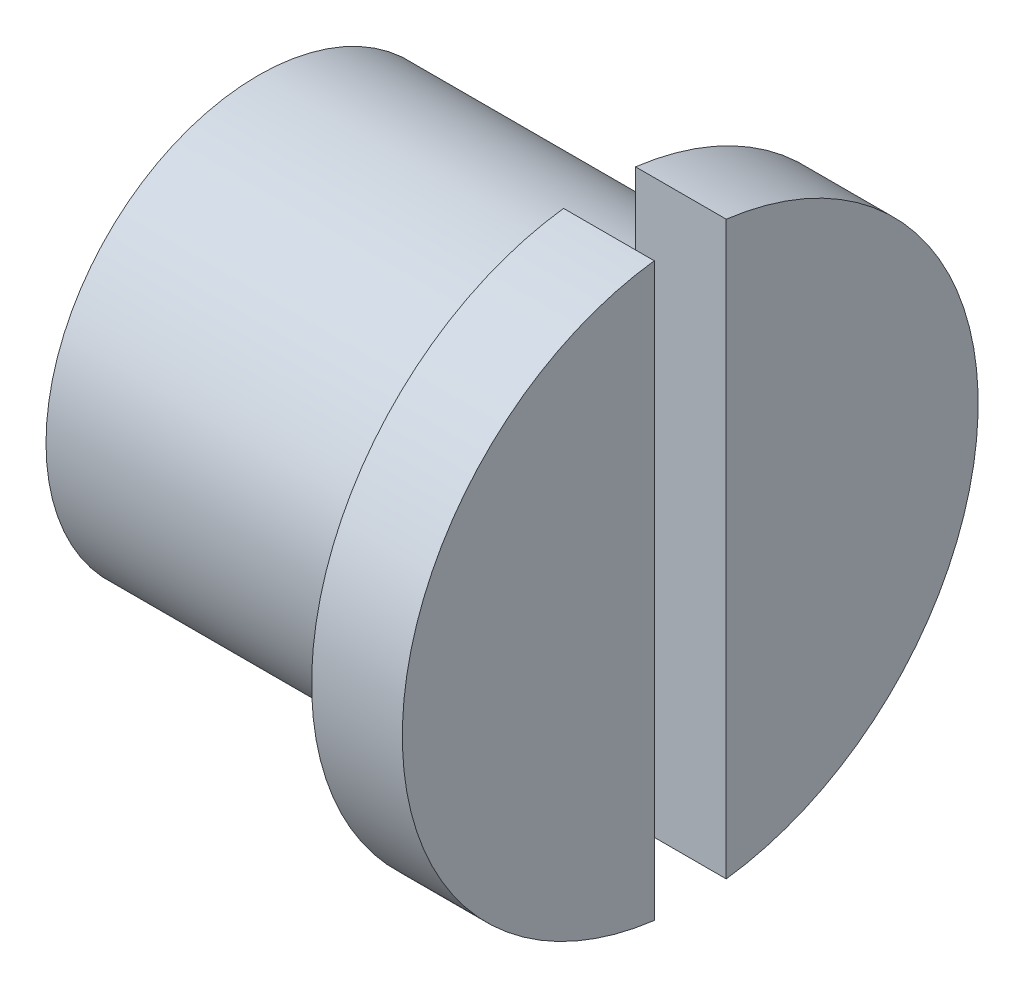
ISO-10303-21;
HEADER;
FILE_DESCRIPTION(('STEP AP214'),'2;1');
FILE_NAME('part.step','',(''),(''),'','','');
FILE_SCHEMA(('AUTOMOTIVE_DESIGN { 1 0 10303 214 1 1 1 1 }'));
ENDSEC;
DATA;
#1=APPLICATION_CONTEXT('core data for automotive mechanical design processes');
#2=APPLICATION_PROTOCOL_DEFINITION('international standard','automotive_design',2000,#1);
#3=PRODUCT_CONTEXT('',#1,'mechanical');
#4=PRODUCT('Part','Part','',(#3));
#5=PRODUCT_RELATED_PRODUCT_CATEGORY('part','',(#4));
#6=PRODUCT_DEFINITION_FORMATION('','',#4);
#7=PRODUCT_DEFINITION_CONTEXT('part definition',#1,'design');
#8=PRODUCT_DEFINITION('design','',#6,#7);
#9=PRODUCT_DEFINITION_SHAPE('','',#8);
#10=(LENGTH_UNIT() NAMED_UNIT(*) SI_UNIT(.MILLI.,.METRE.));
#11=(NAMED_UNIT(*) PLANE_ANGLE_UNIT() SI_UNIT($,.RADIAN.));
#12=(NAMED_UNIT(*) SI_UNIT($,.STERADIAN.) SOLID_ANGLE_UNIT());
#13=UNCERTAINTY_MEASURE_WITH_UNIT(LENGTH_MEASURE(1.E-05),#10,'distance_accuracy_value','');
#14=(GEOMETRIC_REPRESENTATION_CONTEXT(3) GLOBAL_UNCERTAINTY_ASSIGNED_CONTEXT((#13)) GLOBAL_UNIT_ASSIGNED_CONTEXT((#10,
#11,#12)) REPRESENTATION_CONTEXT('',''));
#15=CARTESIAN_POINT('',(0.,0.,0.));
#16=DIRECTION('',(0.,0.,1.));
#17=DIRECTION('',(1.,0.,0.));
#18=AXIS2_PLACEMENT_3D('',#15,#16,#17);
#19=CARTESIAN_POINT('',(6.0198,3.7465,0.));
#20=DIRECTION('',(-1.,0.,0.));
#21=DIRECTION('',(0.,-1.,0.));
#22=AXIS2_PLACEMENT_3D('',#19,#20,#21);
#23=PLANE('',#22);
#24=DIRECTION('',(0.,-1.,0.));
#25=VECTOR('',#24,1.);
#26=CARTESIAN_POINT('',(6.0198,5.29259397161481,0.635));
#27=LINE('',#26,#25);
#28=CARTESIAN_POINT('',(6.0198,-3.69229430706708,0.634999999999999));
#29=VERTEX_POINT('',#28);
#30=CARTESIAN_POINT('',(6.0198,-5.04015624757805,0.634999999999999));
#31=VERTEX_POINT('',#30);
#32=EDGE_CURVE('E132',#29,#31,#27,.T.);
#33=ORIENTED_EDGE('',*,*,#32,.T.);
#34=CARTESIAN_POINT('',(6.0198,0.,0.));
#35=DIRECTION('',(1.,0.,0.));
#36=DIRECTION('',(0.,1.,0.));
#37=AXIS2_PLACEMENT_3D('',#34,#35,#36);
#38=CIRCLE('',#37,5.08);
#39=CARTESIAN_POINT('',(6.0198,5.04015624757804,0.635));
#40=VERTEX_POINT('',#39);
#41=EDGE_CURVE('E104',#40,#31,#38,.T.);
#42=ORIENTED_EDGE('',*,*,#41,.F.);
#43=CARTESIAN_POINT('',(6.0198,3.69229430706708,0.635));
#44=VERTEX_POINT('',#43);
#45=EDGE_CURVE('E135',#40,#44,#27,.T.);
#46=ORIENTED_EDGE('',*,*,#45,.T.);
#47=CARTESIAN_POINT('',(6.0198,0.,0.));
#48=DIRECTION('',(1.,0.,0.));
#49=DIRECTION('',(0.,1.,0.));
#50=AXIS2_PLACEMENT_3D('',#47,#48,#49);
#51=CIRCLE('',#50,3.7465);
#52=EDGE_CURVE('E113',#44,#29,#51,.T.);
#53=ORIENTED_EDGE('',*,*,#52,.T.);
#54=EDGE_LOOP('',(#33,#42,#46,#53));
#55=FACE_BOUND('',#54,.T.);
#56=ADVANCED_FACE('F32',(#55),#23,.T.);
#57=CARTESIAN_POINT('',(7.62,0.,0.));
#58=DIRECTION('',(1.,0.,0.));
#59=DIRECTION('',(0.,1.,0.));
#60=AXIS2_PLACEMENT_3D('',#57,#58,#59);
#61=CYLINDRICAL_SURFACE('',#60,5.08);
#62=DIRECTION('',(1.,0.,0.));
#63=VECTOR('',#62,1.);
#64=CARTESIAN_POINT('',(7.62,-5.04015624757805,0.634999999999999));
#65=LINE('',#64,#63);
#66=CARTESIAN_POINT('',(7.62,-5.04015624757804,0.634999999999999));
#67=VERTEX_POINT('',#66);
#68=EDGE_CURVE('E128',#67,#31,#65,.F.);
#69=ORIENTED_EDGE('',*,*,#68,.F.);
#70=CARTESIAN_POINT('',(7.62,0.,0.));
#71=DIRECTION('',(1.,0.,0.));
#72=DIRECTION('',(0.,1.,0.));
#73=AXIS2_PLACEMENT_3D('',#70,#71,#72);
#74=CIRCLE('',#73,5.08);
#75=CARTESIAN_POINT('',(7.62,5.04015624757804,0.635));
#76=VERTEX_POINT('',#75);
#77=EDGE_CURVE('E105',#76,#67,#74,.T.);
#78=ORIENTED_EDGE('',*,*,#77,.F.);
#79=DIRECTION('',(1.,0.,0.));
#80=VECTOR('',#79,1.);
#81=CARTESIAN_POINT('',(7.62,5.04015624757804,0.635));
#82=LINE('',#81,#80);
#83=EDGE_CURVE('E119',#40,#76,#82,.T.);
#84=ORIENTED_EDGE('',*,*,#83,.F.);
#85=ORIENTED_EDGE('',*,*,#41,.T.);
#86=EDGE_LOOP('',(#69,#78,#84,#85));
#87=FACE_BOUND('',#86,.T.);
#88=ADVANCED_FACE('F146',(#87),#61,.T.);
#89=CARTESIAN_POINT('',(7.62,5.08,0.));
#90=DIRECTION('',(1.,0.,0.));
#91=DIRECTION('',(0.,1.,0.));
#92=AXIS2_PLACEMENT_3D('',#89,#90,#91);
#93=PLANE('',#92);
#94=DIRECTION('',(0.,-1.,0.));
#95=VECTOR('',#94,1.);
#96=CARTESIAN_POINT('',(7.62,5.08,0.635));
#97=LINE('',#96,#95);
#98=EDGE_CURVE('E11',#76,#67,#97,.T.);
#99=ORIENTED_EDGE('',*,*,#98,.F.);
#100=ORIENTED_EDGE('',*,*,#77,.T.);
#101=EDGE_LOOP('',(#99,#100));
#102=FACE_BOUND('',#101,.T.);
#103=ADVANCED_FACE('F150',(#102),#93,.T.);
#104=CARTESIAN_POINT('',(0.,0.,0.));
#105=DIRECTION('',(-1.,0.,0.));
#106=DIRECTION('',(0.,-1.,0.));
#107=AXIS2_PLACEMENT_3D('',#104,#105,#106);
#108=PLANE('',#107);
#109=CARTESIAN_POINT('',(0.,0.,0.));
#110=DIRECTION('',(1.,0.,0.));
#111=DIRECTION('',(0.,1.,0.));
#112=AXIS2_PLACEMENT_3D('',#109,#110,#111);
#113=CIRCLE('',#112,3.7465);
#114=CARTESIAN_POINT('',(0.,3.7465,0.));
#115=VERTEX_POINT('',#114);
#116=EDGE_CURVE('E116',#115,#115,#113,.T.);
#117=ORIENTED_EDGE('',*,*,#116,.F.);
#118=EDGE_LOOP('',(#117));
#119=FACE_BOUND('',#118,.T.);
#120=ADVANCED_FACE('F34',(#119),#108,.T.);
#121=CARTESIAN_POINT('',(7.62,0.,0.));
#122=DIRECTION('',(1.,0.,0.));
#123=DIRECTION('',(0.,1.,0.));
#124=AXIS2_PLACEMENT_3D('',#121,#122,#123);
#125=CYLINDRICAL_SURFACE('',#124,3.7465);
#126=ORIENTED_EDGE('',*,*,#116,.T.);
#127=EDGE_LOOP('',(#126));
#128=FACE_BOUND('',#127,.T.);
#129=ORIENTED_EDGE('',*,*,#52,.F.);
#130=CARTESIAN_POINT('',(6.0198,0.,0.));
#131=DIRECTION('',(-1.,0.,0.));
#132=DIRECTION('',(0.,-1.,0.));
#133=AXIS2_PLACEMENT_3D('',#130,#131,#132);
#134=CIRCLE('',#133,3.7465);
#135=CARTESIAN_POINT('',(6.0198,3.69229430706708,-0.635));
#136=VERTEX_POINT('',#135);
#137=EDGE_CURVE('E122',#136,#44,#134,.F.);
#138=ORIENTED_EDGE('',*,*,#137,.F.);
#139=CARTESIAN_POINT('',(6.0198,-3.69229430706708,-0.635000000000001));
#140=VERTEX_POINT('',#139);
#141=EDGE_CURVE('E108',#140,#136,#51,.T.);
#142=ORIENTED_EDGE('',*,*,#141,.F.);
#143=EDGE_CURVE('E123',#29,#140,#134,.F.);
#144=ORIENTED_EDGE('',*,*,#143,.F.);
#145=EDGE_LOOP('',(#129,#138,#142,#144));
#146=FACE_BOUND('',#145,.T.);
#147=ADVANCED_FACE('F143',(#128,#146),#125,.T.);
#148=DIRECTION('',(0.,1.,0.));
#149=VECTOR('',#148,1.);
#150=CARTESIAN_POINT('',(6.0198,-5.391213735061,-0.635000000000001));
#151=LINE('',#150,#149);
#152=CARTESIAN_POINT('',(6.0198,5.04015624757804,-0.635));
#153=VERTEX_POINT('',#152);
#154=EDGE_CURVE('E91',#136,#153,#151,.T.);
#155=ORIENTED_EDGE('',*,*,#154,.T.);
#156=CARTESIAN_POINT('',(6.0198,-5.04015624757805,-0.635000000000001));
#157=VERTEX_POINT('',#156);
#158=EDGE_CURVE('E97',#157,#153,#38,.T.);
#159=ORIENTED_EDGE('',*,*,#158,.F.);
#160=EDGE_CURVE('E82',#157,#140,#151,.T.);
#161=ORIENTED_EDGE('',*,*,#160,.T.);
#162=ORIENTED_EDGE('',*,*,#141,.T.);
#163=EDGE_LOOP('',(#155,#159,#161,#162));
#164=FACE_BOUND('',#163,.T.);
#165=ADVANCED_FACE('F103',(#164),#23,.T.);
#166=DIRECTION('',(1.,0.,0.));
#167=VECTOR('',#166,1.);
#168=CARTESIAN_POINT('',(7.62,5.04015624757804,-0.635));
#169=LINE('',#168,#167);
#170=CARTESIAN_POINT('',(7.62,5.04015624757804,-0.635));
#171=VERTEX_POINT('',#170);
#172=EDGE_CURVE('E100',#171,#153,#169,.F.);
#173=ORIENTED_EDGE('',*,*,#172,.F.);
#174=CARTESIAN_POINT('',(7.62,-5.04015624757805,-0.635000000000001));
#175=VERTEX_POINT('',#174);
#176=EDGE_CURVE('E99',#175,#171,#74,.T.);
#177=ORIENTED_EDGE('',*,*,#176,.F.);
#178=DIRECTION('',(1.,0.,0.));
#179=VECTOR('',#178,1.);
#180=CARTESIAN_POINT('',(7.62,-5.04015624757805,-0.635000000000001));
#181=LINE('',#180,#179);
#182=EDGE_CURVE('E47',#157,#175,#181,.T.);
#183=ORIENTED_EDGE('',*,*,#182,.F.);
#184=ORIENTED_EDGE('',*,*,#158,.T.);
#185=EDGE_LOOP('',(#173,#177,#183,#184));
#186=FACE_BOUND('',#185,.T.);
#187=ADVANCED_FACE('F96',(#186),#61,.T.);
#188=DIRECTION('',(0.,1.,0.));
#189=VECTOR('',#188,1.);
#190=CARTESIAN_POINT('',(7.62,5.08,-0.635));
#191=LINE('',#190,#189);
#192=EDGE_CURVE('E40',#175,#171,#191,.T.);
#193=ORIENTED_EDGE('',*,*,#192,.F.);
#194=ORIENTED_EDGE('',*,*,#176,.T.);
#195=EDGE_LOOP('',(#193,#194));
#196=FACE_BOUND('',#195,.T.);
#197=ADVANCED_FACE('F121',(#196),#93,.T.);
#198=CARTESIAN_POINT('',(6.0198,3.7465,0.));
#199=DIRECTION('',(-1.,0.,0.));
#200=DIRECTION('',(0.,-1.,0.));
#201=AXIS2_PLACEMENT_3D('',#198,#199,#200);
#202=PLANE('',#201);
#203=ORIENTED_EDGE('',*,*,#137,.T.);
#204=EDGE_CURVE('E134',#44,#29,#27,.T.);
#205=ORIENTED_EDGE('',*,*,#204,.T.);
#206=ORIENTED_EDGE('',*,*,#143,.T.);
#207=EDGE_CURVE('E85',#140,#136,#151,.T.);
#208=ORIENTED_EDGE('',*,*,#207,.T.);
#209=EDGE_LOOP('',(#203,#205,#206,#208));
#210=FACE_BOUND('',#209,.T.);
#211=ADVANCED_FACE('F141',(#210),#202,.F.);
#212=CARTESIAN_POINT('',(-4.73922630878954,5.29259397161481,0.635));
#213=DIRECTION('',(0.,0.,1.));
#214=DIRECTION('',(0.,-1.,0.));
#215=AXIS2_PLACEMENT_3D('',#212,#213,#214);
#216=PLANE('',#215);
#217=ORIENTED_EDGE('',*,*,#68,.T.);
#218=ORIENTED_EDGE('',*,*,#32,.F.);
#219=ORIENTED_EDGE('',*,*,#204,.F.);
#220=ORIENTED_EDGE('',*,*,#45,.F.);
#221=ORIENTED_EDGE('',*,*,#83,.T.);
#222=ORIENTED_EDGE('',*,*,#98,.T.);
#223=EDGE_LOOP('',(#217,#218,#219,#220,#221,#222));
#224=FACE_BOUND('',#223,.T.);
#225=ADVANCED_FACE('F148',(#224),#216,.F.);
#226=CARTESIAN_POINT('',(-4.73922630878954,-5.391213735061,-0.635000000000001));
#227=DIRECTION('',(0.,0.,-1.));
#228=DIRECTION('',(0.,1.,0.));
#229=AXIS2_PLACEMENT_3D('',#226,#227,#228);
#230=PLANE('',#229);
#231=ORIENTED_EDGE('',*,*,#172,.T.);
#232=ORIENTED_EDGE('',*,*,#154,.F.);
#233=ORIENTED_EDGE('',*,*,#207,.F.);
#234=ORIENTED_EDGE('',*,*,#160,.F.);
#235=ORIENTED_EDGE('',*,*,#182,.T.);
#236=ORIENTED_EDGE('',*,*,#192,.T.);
#237=EDGE_LOOP('',(#231,#232,#233,#234,#235,#236));
#238=FACE_BOUND('',#237,.T.);
#239=ADVANCED_FACE('F83',(#238),#230,.F.);
#240=CLOSED_SHELL('',(#56,#88,#103,#120,#147,#165,#187,#197,#211,#225,#239));
#241=MANIFOLD_SOLID_BREP('B2',#240);
#242=ADVANCED_BREP_SHAPE_REPRESENTATION('',(#18,#241),#14);
#243=SHAPE_DEFINITION_REPRESENTATION(#9,#242);
ENDSEC;
END-ISO-10303-21;
